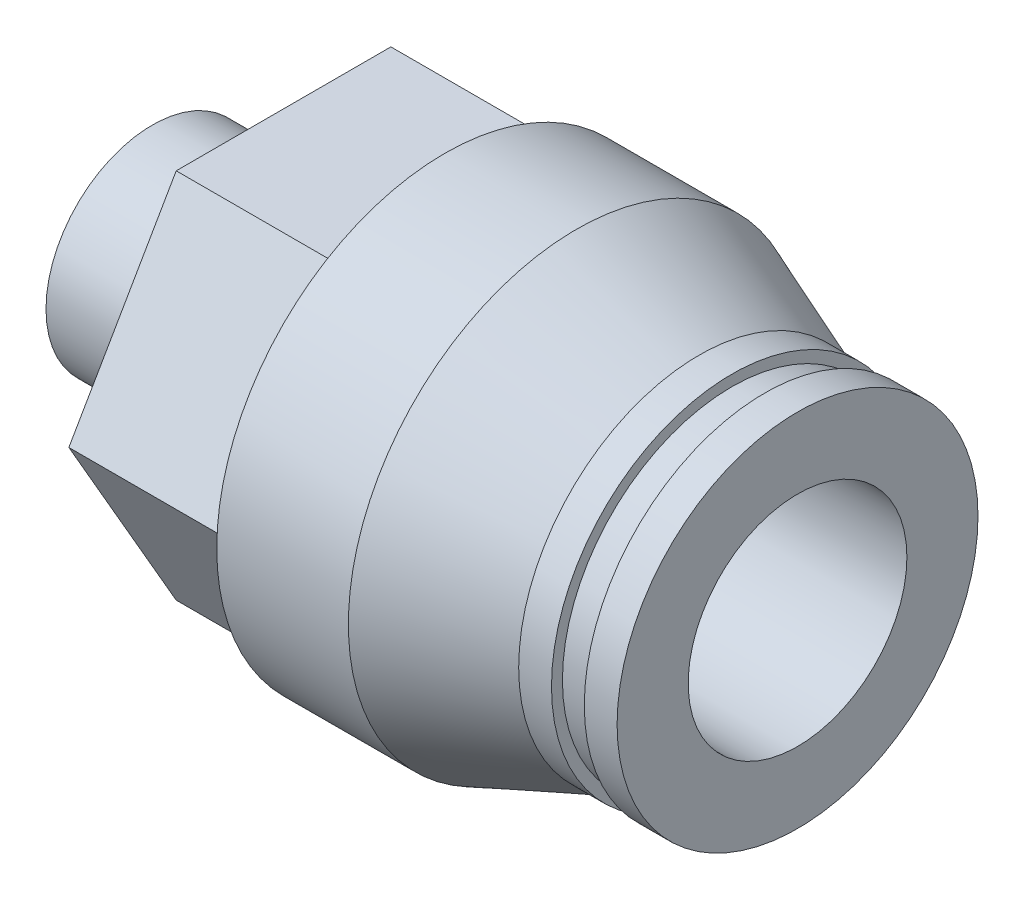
ISO-10303-21;
HEADER;
FILE_DESCRIPTION(('STEP AP214'),'2;1');
FILE_NAME('part.step','',(''),(''),'','','');
FILE_SCHEMA(('AUTOMOTIVE_DESIGN { 1 0 10303 214 1 1 1 1 }'));
ENDSEC;
DATA;
#1=APPLICATION_CONTEXT('core data for automotive mechanical design processes');
#2=APPLICATION_PROTOCOL_DEFINITION('international standard','automotive_design',2000,#1);
#3=PRODUCT_CONTEXT('',#1,'mechanical');
#4=PRODUCT('Part','Part','',(#3));
#5=PRODUCT_RELATED_PRODUCT_CATEGORY('part','',(#4));
#6=PRODUCT_DEFINITION_FORMATION('','',#4);
#7=PRODUCT_DEFINITION_CONTEXT('part definition',#1,'design');
#8=PRODUCT_DEFINITION('design','',#6,#7);
#9=PRODUCT_DEFINITION_SHAPE('','',#8);
#10=(LENGTH_UNIT() NAMED_UNIT(*) SI_UNIT(.MILLI.,.METRE.));
#11=(NAMED_UNIT(*) PLANE_ANGLE_UNIT() SI_UNIT($,.RADIAN.));
#12=(NAMED_UNIT(*) SI_UNIT($,.STERADIAN.) SOLID_ANGLE_UNIT());
#13=UNCERTAINTY_MEASURE_WITH_UNIT(LENGTH_MEASURE(1.E-05),#10,'distance_accuracy_value','');
#14=(GEOMETRIC_REPRESENTATION_CONTEXT(3) GLOBAL_UNCERTAINTY_ASSIGNED_CONTEXT((#13)) GLOBAL_UNIT_ASSIGNED_CONTEXT((#10,
#11,#12)) REPRESENTATION_CONTEXT('',''));
#15=CARTESIAN_POINT('',(0.,0.,0.));
#16=DIRECTION('',(0.,0.,1.));
#17=DIRECTION('',(1.,0.,0.));
#18=AXIS2_PLACEMENT_3D('',#15,#16,#17);
#19=CARTESIAN_POINT('',(6.,4.86,0.));
#20=DIRECTION('',(-1.,0.,0.));
#21=DIRECTION('',(0.,0.,1.));
#22=AXIS2_PLACEMENT_3D('',#19,#20,#21);
#23=PLANE('',#22);
#24=CARTESIAN_POINT('',(6.,0.,0.));
#25=DIRECTION('',(1.,0.,0.));
#26=DIRECTION('',(0.,0.,-1.));
#27=AXIS2_PLACEMENT_3D('',#24,#25,#26);
#28=CIRCLE('',#27,4.86);
#29=CARTESIAN_POINT('',(6.,0.,-4.86));
#30=VERTEX_POINT('',#29);
#31=EDGE_CURVE('E219',#30,#30,#28,.T.);
#32=ORIENTED_EDGE('',*,*,#31,.T.);
#33=EDGE_LOOP('',(#32));
#34=FACE_BOUND('',#33,.T.);
#35=DIRECTION('',(0.,-0.866025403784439,0.5));
#36=VECTOR('',#35,1.);
#37=CARTESIAN_POINT('',(6.,0.,-9.81495457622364));
#38=LINE('',#37,#36);
#39=CARTESIAN_POINT('',(6.,0.,-9.81495457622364));
#40=VERTEX_POINT('',#39);
#41=CARTESIAN_POINT('',(6.,-8.5,-4.90747728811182));
#42=VERTEX_POINT('',#41);
#43=EDGE_CURVE('E128',#40,#42,#38,.T.);
#44=ORIENTED_EDGE('',*,*,#43,.T.);
#45=DIRECTION('',(0.,0.,1.));
#46=VECTOR('',#45,1.);
#47=CARTESIAN_POINT('',(6.,-8.5,-4.90747728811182));
#48=LINE('',#47,#46);
#49=CARTESIAN_POINT('',(6.,-8.5,4.90747728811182));
#50=VERTEX_POINT('',#49);
#51=EDGE_CURVE('E111',#42,#50,#48,.T.);
#52=ORIENTED_EDGE('',*,*,#51,.T.);
#53=DIRECTION('',(0.,0.866025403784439,0.5));
#54=VECTOR('',#53,1.);
#55=CARTESIAN_POINT('',(6.,-8.5,4.90747728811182));
#56=LINE('',#55,#54);
#57=CARTESIAN_POINT('',(6.,0.,9.81495457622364));
#58=VERTEX_POINT('',#57);
#59=EDGE_CURVE('E122',#50,#58,#56,.T.);
#60=ORIENTED_EDGE('',*,*,#59,.T.);
#61=DIRECTION('',(0.,0.866025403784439,-0.5));
#62=VECTOR('',#61,1.);
#63=CARTESIAN_POINT('',(6.,0.,9.81495457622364));
#64=LINE('',#63,#62);
#65=CARTESIAN_POINT('',(6.,8.5,4.90747728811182));
#66=VERTEX_POINT('',#65);
#67=EDGE_CURVE('E31',#58,#66,#64,.T.);
#68=ORIENTED_EDGE('',*,*,#67,.T.);
#69=DIRECTION('',(0.,0.,-1.));
#70=VECTOR('',#69,1.);
#71=CARTESIAN_POINT('',(6.,8.5,4.90747728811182));
#72=LINE('',#71,#70);
#73=CARTESIAN_POINT('',(6.,8.5,-4.90747728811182));
#74=VERTEX_POINT('',#73);
#75=EDGE_CURVE('E132',#66,#74,#72,.T.);
#76=ORIENTED_EDGE('',*,*,#75,.T.);
#77=DIRECTION('',(0.,-0.866025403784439,-0.5));
#78=VECTOR('',#77,1.);
#79=CARTESIAN_POINT('',(6.,8.5,-4.90747728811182));
#80=LINE('',#79,#78);
#81=EDGE_CURVE('E135',#74,#40,#80,.T.);
#82=ORIENTED_EDGE('',*,*,#81,.T.);
#83=EDGE_LOOP('',(#44,#52,#60,#68,#76,#82));
#84=FACE_BOUND('',#83,.T.);
#85=ADVANCED_FACE('F16',(#34,#84),#23,.T.);
#86=CARTESIAN_POINT('',(0.,0.,0.));
#87=DIRECTION('',(-1.,0.,0.));
#88=DIRECTION('',(0.,0.,1.));
#89=AXIS2_PLACEMENT_3D('',#86,#87,#88);
#90=PLANE('',#89);
#91=CARTESIAN_POINT('',(0.,0.,0.));
#92=DIRECTION('',(1.,0.,0.));
#93=DIRECTION('',(0.,0.,-1.));
#94=AXIS2_PLACEMENT_3D('',#91,#92,#93);
#95=CIRCLE('',#94,4.86);
#96=CARTESIAN_POINT('',(0.,0.,-4.86));
#97=VERTEX_POINT('',#96);
#98=EDGE_CURVE('E222',#97,#97,#95,.T.);
#99=ORIENTED_EDGE('',*,*,#98,.F.);
#100=EDGE_LOOP('',(#99));
#101=FACE_BOUND('',#100,.T.);
#102=DIRECTION('',(0.,-0.866025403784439,-0.5));
#103=VECTOR('',#102,1.);
#104=CARTESIAN_POINT('',(0.,0.,2.88675134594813));
#105=LINE('',#104,#103);
#106=CARTESIAN_POINT('',(0.,0.,2.88675134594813));
#107=VERTEX_POINT('',#106);
#108=CARTESIAN_POINT('',(0.,-2.5,1.44337567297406));
#109=VERTEX_POINT('',#108);
#110=EDGE_CURVE('E177',#107,#109,#105,.T.);
#111=ORIENTED_EDGE('',*,*,#110,.T.);
#112=DIRECTION('',(0.,0.,-1.));
#113=VECTOR('',#112,1.);
#114=CARTESIAN_POINT('',(0.,-2.5,1.44337567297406));
#115=LINE('',#114,#113);
#116=CARTESIAN_POINT('',(0.,-2.5,-1.44337567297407));
#117=VERTEX_POINT('',#116);
#118=EDGE_CURVE('E39',#109,#117,#115,.T.);
#119=ORIENTED_EDGE('',*,*,#118,.T.);
#120=DIRECTION('',(0.,0.866025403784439,-0.5));
#121=VECTOR('',#120,1.);
#122=CARTESIAN_POINT('',(0.,-2.5,-1.44337567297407));
#123=LINE('',#122,#121);
#124=CARTESIAN_POINT('',(0.,0.,-2.88675134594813));
#125=VERTEX_POINT('',#124);
#126=EDGE_CURVE('E165',#117,#125,#123,.T.);
#127=ORIENTED_EDGE('',*,*,#126,.T.);
#128=DIRECTION('',(0.,0.866025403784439,0.5));
#129=VECTOR('',#128,1.);
#130=CARTESIAN_POINT('',(0.,0.,-2.88675134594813));
#131=LINE('',#130,#129);
#132=CARTESIAN_POINT('',(0.,2.5,-1.44337567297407));
#133=VERTEX_POINT('',#132);
#134=EDGE_CURVE('E168',#125,#133,#131,.T.);
#135=ORIENTED_EDGE('',*,*,#134,.T.);
#136=DIRECTION('',(0.,0.,1.));
#137=VECTOR('',#136,1.);
#138=CARTESIAN_POINT('',(0.,2.5,-1.44337567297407));
#139=LINE('',#138,#137);
#140=CARTESIAN_POINT('',(0.,2.5,1.44337567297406));
#141=VERTEX_POINT('',#140);
#142=EDGE_CURVE('E171',#133,#141,#139,.T.);
#143=ORIENTED_EDGE('',*,*,#142,.T.);
#144=DIRECTION('',(0.,-0.866025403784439,0.5));
#145=VECTOR('',#144,1.);
#146=CARTESIAN_POINT('',(0.,2.5,1.44337567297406));
#147=LINE('',#146,#145);
#148=EDGE_CURVE('E174',#141,#107,#147,.T.);
#149=ORIENTED_EDGE('',*,*,#148,.T.);
#150=EDGE_LOOP('',(#111,#119,#127,#135,#143,#149));
#151=FACE_BOUND('',#150,.T.);
#152=ADVANCED_FACE('F18',(#101,#151),#90,.T.);
#153=CARTESIAN_POINT('',(11.,5.,0.));
#154=DIRECTION('',(1.,0.,0.));
#155=DIRECTION('',(0.,0.,-1.));
#156=AXIS2_PLACEMENT_3D('',#153,#154,#155);
#157=PLANE('',#156);
#158=CARTESIAN_POINT('',(11.,0.,0.));
#159=DIRECTION('',(1.,0.,0.));
#160=DIRECTION('',(0.,0.,-1.));
#161=AXIS2_PLACEMENT_3D('',#158,#159,#160);
#162=CIRCLE('',#161,5.);
#163=CARTESIAN_POINT('',(11.,0.,-5.));
#164=VERTEX_POINT('',#163);
#165=EDGE_CURVE('E192',#164,#164,#162,.T.);
#166=ORIENTED_EDGE('',*,*,#165,.T.);
#167=EDGE_LOOP('',(#166));
#168=FACE_BOUND('',#167,.T.);
#169=DIRECTION('',(0.,-0.866025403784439,0.5));
#170=VECTOR('',#169,1.);
#171=CARTESIAN_POINT('',(11.,2.5,-4.3301270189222));
#172=LINE('',#171,#170);
#173=CARTESIAN_POINT('',(11.,0.,-2.88675134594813));
#174=VERTEX_POINT('',#173);
#175=CARTESIAN_POINT('',(11.,-2.5,-1.44337567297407));
#176=VERTEX_POINT('',#175);
#177=EDGE_CURVE('E24',#174,#176,#172,.T.);
#178=ORIENTED_EDGE('',*,*,#177,.T.);
#179=DIRECTION('',(0.,0.,1.));
#180=VECTOR('',#179,1.);
#181=CARTESIAN_POINT('',(11.,-2.5,0.));
#182=LINE('',#181,#180);
#183=CARTESIAN_POINT('',(11.,-2.5,1.44337567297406));
#184=VERTEX_POINT('',#183);
#185=EDGE_CURVE('E10',#176,#184,#182,.T.);
#186=ORIENTED_EDGE('',*,*,#185,.T.);
#187=DIRECTION('',(0.,0.866025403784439,0.5));
#188=VECTOR('',#187,1.);
#189=CARTESIAN_POINT('',(11.,2.5,4.33012701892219));
#190=LINE('',#189,#188);
#191=CARTESIAN_POINT('',(11.,0.,2.88675134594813));
#192=VERTEX_POINT('',#191);
#193=EDGE_CURVE('E225',#184,#192,#190,.T.);
#194=ORIENTED_EDGE('',*,*,#193,.T.);
#195=DIRECTION('',(0.,0.866025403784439,-0.5));
#196=VECTOR('',#195,1.);
#197=CARTESIAN_POINT('',(11.,5.,0.));
#198=LINE('',#197,#196);
#199=CARTESIAN_POINT('',(11.,2.5,1.44337567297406));
#200=VERTEX_POINT('',#199);
#201=EDGE_CURVE('E228',#192,#200,#198,.T.);
#202=ORIENTED_EDGE('',*,*,#201,.T.);
#203=DIRECTION('',(0.,0.,-1.));
#204=VECTOR('',#203,1.);
#205=CARTESIAN_POINT('',(11.,2.5,0.));
#206=LINE('',#205,#204);
#207=CARTESIAN_POINT('',(11.,2.5,-1.44337567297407));
#208=VERTEX_POINT('',#207);
#209=EDGE_CURVE('E231',#200,#208,#206,.T.);
#210=ORIENTED_EDGE('',*,*,#209,.T.);
#211=DIRECTION('',(0.,-0.866025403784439,-0.5));
#212=VECTOR('',#211,1.);
#213=CARTESIAN_POINT('',(11.,5.,0.));
#214=LINE('',#213,#212);
#215=EDGE_CURVE('E234',#208,#174,#214,.T.);
#216=ORIENTED_EDGE('',*,*,#215,.T.);
#217=EDGE_LOOP('',(#178,#186,#194,#202,#210,#216));
#218=FACE_BOUND('',#217,.T.);
#219=ADVANCED_FACE('F238',(#168,#218),#157,.T.);
#220=CARTESIAN_POINT('',(0.,0.,0.));
#221=DIRECTION('',(1.,0.,0.));
#222=DIRECTION('',(0.,0.,-1.));
#223=AXIS2_PLACEMENT_3D('',#220,#221,#222);
#224=CYLINDRICAL_SURFACE('',#223,4.86);
#225=ORIENTED_EDGE('',*,*,#98,.T.);
#226=EDGE_LOOP('',(#225));
#227=FACE_BOUND('',#226,.T.);
#228=ORIENTED_EDGE('',*,*,#31,.F.);
#229=EDGE_LOOP('',(#228));
#230=FACE_BOUND('',#229,.T.);
#231=ADVANCED_FACE('F279',(#227,#230),#224,.T.);
#232=CARTESIAN_POINT('',(0.,0.,0.));
#233=DIRECTION('',(1.,0.,0.));
#234=DIRECTION('',(0.,0.,-1.));
#235=AXIS2_PLACEMENT_3D('',#232,#233,#234);
#236=CYLINDRICAL_SURFACE('',#235,10.4285325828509);
#237=CARTESIAN_POINT('',(13.375,0.,0.));
#238=DIRECTION('',(-1.,0.,0.));
#239=DIRECTION('',(0.,0.,1.));
#240=AXIS2_PLACEMENT_3D('',#237,#238,#239);
#241=CIRCLE('',#240,10.4285325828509);
#242=CARTESIAN_POINT('',(13.375,0.,10.4285325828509));
#243=VERTEX_POINT('',#242);
#244=EDGE_CURVE('E154',#243,#243,#241,.F.);
#245=ORIENTED_EDGE('',*,*,#244,.T.);
#246=EDGE_LOOP('',(#245));
#247=FACE_BOUND('',#246,.T.);
#248=CARTESIAN_POINT('',(19.3916292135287,0.,0.));
#249=DIRECTION('',(1.,0.,0.));
#250=DIRECTION('',(0.,0.,-1.));
#251=AXIS2_PLACEMENT_3D('',#248,#249,#250);
#252=CIRCLE('',#251,10.4285325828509);
#253=CARTESIAN_POINT('',(19.3916292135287,0.,-10.4285325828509));
#254=VERTEX_POINT('',#253);
#255=EDGE_CURVE('E216',#254,#254,#252,.T.);
#256=ORIENTED_EDGE('',*,*,#255,.F.);
#257=EDGE_LOOP('',(#256));
#258=FACE_BOUND('',#257,.T.);
#259=ADVANCED_FACE('F277',(#247,#258),#236,.T.);
#260=CARTESIAN_POINT('',(25.,0.,0.));
#261=DIRECTION('',(-1.,0.,0.));
#262=DIRECTION('',(0.,0.,1.));
#263=AXIS2_PLACEMENT_3D('',#260,#261,#262);
#264=CONICAL_SURFACE('',#263,8.25,0.370503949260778);
#265=ORIENTED_EDGE('',*,*,#255,.T.);
#266=EDGE_LOOP('',(#265));
#267=FACE_BOUND('',#266,.T.);
#268=CARTESIAN_POINT('',(25.,0.,0.));
#269=DIRECTION('',(1.,0.,0.));
#270=DIRECTION('',(0.,0.,-1.));
#271=AXIS2_PLACEMENT_3D('',#268,#269,#270);
#272=CIRCLE('',#271,8.25);
#273=CARTESIAN_POINT('',(25.,0.,-8.25));
#274=VERTEX_POINT('',#273);
#275=EDGE_CURVE('E213',#274,#274,#272,.T.);
#276=ORIENTED_EDGE('',*,*,#275,.F.);
#277=EDGE_LOOP('',(#276));
#278=FACE_BOUND('',#277,.T.);
#279=ADVANCED_FACE('F286',(#267,#278),#264,.T.);
#280=CARTESIAN_POINT('',(0.,0.,0.));
#281=DIRECTION('',(1.,0.,0.));
#282=DIRECTION('',(0.,0.,-1.));
#283=AXIS2_PLACEMENT_3D('',#280,#281,#282);
#284=CYLINDRICAL_SURFACE('',#283,8.25);
#285=ORIENTED_EDGE('',*,*,#275,.T.);
#286=EDGE_LOOP('',(#285));
#287=FACE_BOUND('',#286,.T.);
#288=CARTESIAN_POINT('',(26.5,0.,0.));
#289=DIRECTION('',(1.,0.,0.));
#290=DIRECTION('',(0.,0.,-1.));
#291=AXIS2_PLACEMENT_3D('',#288,#289,#290);
#292=CIRCLE('',#291,8.25);
#293=CARTESIAN_POINT('',(26.5,0.,-8.25));
#294=VERTEX_POINT('',#293);
#295=EDGE_CURVE('E210',#294,#294,#292,.T.);
#296=ORIENTED_EDGE('',*,*,#295,.F.);
#297=EDGE_LOOP('',(#296));
#298=FACE_BOUND('',#297,.T.);
#299=ADVANCED_FACE('F313',(#287,#298),#284,.T.);
#300=CARTESIAN_POINT('',(26.5,8.25,0.));
#301=DIRECTION('',(1.,0.,0.));
#302=DIRECTION('',(0.,0.,-1.));
#303=AXIS2_PLACEMENT_3D('',#300,#301,#302);
#304=PLANE('',#303);
#305=ORIENTED_EDGE('',*,*,#295,.T.);
#306=EDGE_LOOP('',(#305));
#307=FACE_BOUND('',#306,.T.);
#308=CARTESIAN_POINT('',(26.5,0.,0.));
#309=DIRECTION('',(1.,0.,0.));
#310=DIRECTION('',(0.,0.,-1.));
#311=AXIS2_PLACEMENT_3D('',#308,#309,#310);
#312=CIRCLE('',#311,7.75);
#313=CARTESIAN_POINT('',(26.5,0.,-7.75));
#314=VERTEX_POINT('',#313);
#315=EDGE_CURVE('E207',#314,#314,#312,.T.);
#316=ORIENTED_EDGE('',*,*,#315,.F.);
#317=EDGE_LOOP('',(#316));
#318=FACE_BOUND('',#317,.T.);
#319=ADVANCED_FACE('F309',(#307,#318),#304,.T.);
#320=CARTESIAN_POINT('',(0.,0.,0.));
#321=DIRECTION('',(1.,0.,0.));
#322=DIRECTION('',(0.,0.,-1.));
#323=AXIS2_PLACEMENT_3D('',#320,#321,#322);
#324=CYLINDRICAL_SURFACE('',#323,7.75);
#325=ORIENTED_EDGE('',*,*,#315,.T.);
#326=EDGE_LOOP('',(#325));
#327=FACE_BOUND('',#326,.T.);
#328=CARTESIAN_POINT('',(28.,0.,0.));
#329=DIRECTION('',(1.,0.,0.));
#330=DIRECTION('',(0.,0.,-1.));
#331=AXIS2_PLACEMENT_3D('',#328,#329,#330);
#332=CIRCLE('',#331,7.75);
#333=CARTESIAN_POINT('',(28.,0.,-7.75));
#334=VERTEX_POINT('',#333);
#335=EDGE_CURVE('E204',#334,#334,#332,.T.);
#336=ORIENTED_EDGE('',*,*,#335,.F.);
#337=EDGE_LOOP('',(#336));
#338=FACE_BOUND('',#337,.T.);
#339=ADVANCED_FACE('F305',(#327,#338),#324,.T.);
#340=CARTESIAN_POINT('',(28.,7.75,0.));
#341=DIRECTION('',(-1.,0.,0.));
#342=DIRECTION('',(0.,0.,1.));
#343=AXIS2_PLACEMENT_3D('',#340,#341,#342);
#344=PLANE('',#343);
#345=ORIENTED_EDGE('',*,*,#335,.T.);
#346=EDGE_LOOP('',(#345));
#347=FACE_BOUND('',#346,.T.);
#348=CARTESIAN_POINT('',(28.,0.,0.));
#349=DIRECTION('',(1.,0.,0.));
#350=DIRECTION('',(0.,0.,-1.));
#351=AXIS2_PLACEMENT_3D('',#348,#349,#350);
#352=CIRCLE('',#351,8.25);
#353=CARTESIAN_POINT('',(28.,0.,-8.25));
#354=VERTEX_POINT('',#353);
#355=EDGE_CURVE('E201',#354,#354,#352,.T.);
#356=ORIENTED_EDGE('',*,*,#355,.F.);
#357=EDGE_LOOP('',(#356));
#358=FACE_BOUND('',#357,.T.);
#359=ADVANCED_FACE('F301',(#347,#358),#344,.T.);
#360=CARTESIAN_POINT('',(0.,0.,0.));
#361=DIRECTION('',(1.,0.,0.));
#362=DIRECTION('',(0.,0.,-1.));
#363=AXIS2_PLACEMENT_3D('',#360,#361,#362);
#364=CYLINDRICAL_SURFACE('',#363,8.25);
#365=ORIENTED_EDGE('',*,*,#355,.T.);
#366=EDGE_LOOP('',(#365));
#367=FACE_BOUND('',#366,.T.);
#368=CARTESIAN_POINT('',(29.5,0.,0.));
#369=DIRECTION('',(1.,0.,0.));
#370=DIRECTION('',(0.,0.,-1.));
#371=AXIS2_PLACEMENT_3D('',#368,#369,#370);
#372=CIRCLE('',#371,8.25);
#373=CARTESIAN_POINT('',(29.5,0.,-8.25));
#374=VERTEX_POINT('',#373);
#375=EDGE_CURVE('E198',#374,#374,#372,.T.);
#376=ORIENTED_EDGE('',*,*,#375,.F.);
#377=EDGE_LOOP('',(#376));
#378=FACE_BOUND('',#377,.T.);
#379=ADVANCED_FACE('F297',(#367,#378),#364,.T.);
#380=CARTESIAN_POINT('',(29.5,8.25,0.));
#381=DIRECTION('',(1.,0.,0.));
#382=DIRECTION('',(0.,0.,-1.));
#383=AXIS2_PLACEMENT_3D('',#380,#381,#382);
#384=PLANE('',#383);
#385=ORIENTED_EDGE('',*,*,#375,.T.);
#386=EDGE_LOOP('',(#385));
#387=FACE_BOUND('',#386,.T.);
#388=CARTESIAN_POINT('',(29.5,0.,0.));
#389=DIRECTION('',(1.,0.,0.));
#390=DIRECTION('',(0.,0.,-1.));
#391=AXIS2_PLACEMENT_3D('',#388,#389,#390);
#392=CIRCLE('',#391,5.);
#393=CARTESIAN_POINT('',(29.5,0.,-5.));
#394=VERTEX_POINT('',#393);
#395=EDGE_CURVE('E195',#394,#394,#392,.T.);
#396=ORIENTED_EDGE('',*,*,#395,.F.);
#397=EDGE_LOOP('',(#396));
#398=FACE_BOUND('',#397,.T.);
#399=ADVANCED_FACE('F265',(#387,#398),#384,.T.);
#400=CARTESIAN_POINT('',(0.,0.,0.));
#401=DIRECTION('',(1.,0.,0.));
#402=DIRECTION('',(0.,0.,-1.));
#403=AXIS2_PLACEMENT_3D('',#400,#401,#402);
#404=CYLINDRICAL_SURFACE('',#403,5.);
#405=ORIENTED_EDGE('',*,*,#395,.T.);
#406=EDGE_LOOP('',(#405));
#407=FACE_BOUND('',#406,.T.);
#408=ORIENTED_EDGE('',*,*,#165,.F.);
#409=EDGE_LOOP('',(#408));
#410=FACE_BOUND('',#409,.T.);
#411=ADVANCED_FACE('F257',(#407,#410),#404,.F.);
#412=CARTESIAN_POINT('',(29.5,-2.5,1.44337567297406));
#413=DIRECTION('',(0.,1.,0.));
#414=DIRECTION('',(0.,0.,1.));
#415=AXIS2_PLACEMENT_3D('',#412,#413,#414);
#416=PLANE('',#415);
#417=DIRECTION('',(-1.,0.,0.));
#418=VECTOR('',#417,1.);
#419=CARTESIAN_POINT('',(29.5,-2.5,-1.44337567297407));
#420=LINE('',#419,#418);
#421=EDGE_CURVE('E190',#176,#117,#420,.T.);
#422=ORIENTED_EDGE('',*,*,#421,.T.);
#423=ORIENTED_EDGE('',*,*,#118,.F.);
#424=DIRECTION('',(-1.,0.,0.));
#425=VECTOR('',#424,1.);
#426=CARTESIAN_POINT('',(29.5,-2.5,1.44337567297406));
#427=LINE('',#426,#425);
#428=EDGE_CURVE('E180',#184,#109,#427,.T.);
#429=ORIENTED_EDGE('',*,*,#428,.F.);
#430=ORIENTED_EDGE('',*,*,#185,.F.);
#431=EDGE_LOOP('',(#422,#423,#429,#430));
#432=FACE_BOUND('',#431,.T.);
#433=ADVANCED_FACE('F255',(#432),#416,.T.);
#434=CARTESIAN_POINT('',(29.5,-2.5,-1.44337567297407));
#435=DIRECTION('',(0.,0.5,0.866025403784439));
#436=DIRECTION('',(0.,-0.866025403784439,0.5));
#437=AXIS2_PLACEMENT_3D('',#434,#435,#436);
#438=PLANE('',#437);
#439=DIRECTION('',(-1.,0.,0.));
#440=VECTOR('',#439,1.);
#441=CARTESIAN_POINT('',(29.5,0.,-2.88675134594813));
#442=LINE('',#441,#440);
#443=EDGE_CURVE('E188',#174,#125,#442,.T.);
#444=ORIENTED_EDGE('',*,*,#443,.T.);
#445=ORIENTED_EDGE('',*,*,#126,.F.);
#446=ORIENTED_EDGE('',*,*,#421,.F.);
#447=ORIENTED_EDGE('',*,*,#177,.F.);
#448=EDGE_LOOP('',(#444,#445,#446,#447));
#449=FACE_BOUND('',#448,.T.);
#450=ADVANCED_FACE('F242',(#449),#438,.T.);
#451=CARTESIAN_POINT('',(29.5,0.,-2.88675134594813));
#452=DIRECTION('',(0.,-0.5,0.866025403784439));
#453=DIRECTION('',(0.,-0.866025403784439,-0.5));
#454=AXIS2_PLACEMENT_3D('',#451,#452,#453);
#455=PLANE('',#454);
#456=DIRECTION('',(-1.,0.,0.));
#457=VECTOR('',#456,1.);
#458=CARTESIAN_POINT('',(29.5,2.5,-1.44337567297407));
#459=LINE('',#458,#457);
#460=EDGE_CURVE('E186',#208,#133,#459,.T.);
#461=ORIENTED_EDGE('',*,*,#460,.T.);
#462=ORIENTED_EDGE('',*,*,#134,.F.);
#463=ORIENTED_EDGE('',*,*,#443,.F.);
#464=ORIENTED_EDGE('',*,*,#215,.F.);
#465=EDGE_LOOP('',(#461,#462,#463,#464));
#466=FACE_BOUND('',#465,.T.);
#467=ADVANCED_FACE('F246',(#466),#455,.T.);
#468=CARTESIAN_POINT('',(29.5,2.5,-1.44337567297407));
#469=DIRECTION('',(0.,-1.,0.));
#470=DIRECTION('',(0.,0.,-1.));
#471=AXIS2_PLACEMENT_3D('',#468,#469,#470);
#472=PLANE('',#471);
#473=DIRECTION('',(-1.,0.,0.));
#474=VECTOR('',#473,1.);
#475=CARTESIAN_POINT('',(29.5,2.5,1.44337567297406));
#476=LINE('',#475,#474);
#477=EDGE_CURVE('E184',#200,#141,#476,.T.);
#478=ORIENTED_EDGE('',*,*,#477,.T.);
#479=ORIENTED_EDGE('',*,*,#142,.F.);
#480=ORIENTED_EDGE('',*,*,#460,.F.);
#481=ORIENTED_EDGE('',*,*,#209,.F.);
#482=EDGE_LOOP('',(#478,#479,#480,#481));
#483=FACE_BOUND('',#482,.T.);
#484=ADVANCED_FACE('F406',(#483),#472,.T.);
#485=CARTESIAN_POINT('',(29.5,2.5,1.44337567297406));
#486=DIRECTION('',(0.,-0.5,-0.866025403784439));
#487=DIRECTION('',(0.,0.866025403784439,-0.5));
#488=AXIS2_PLACEMENT_3D('',#485,#486,#487);
#489=PLANE('',#488);
#490=DIRECTION('',(-1.,0.,0.));
#491=VECTOR('',#490,1.);
#492=CARTESIAN_POINT('',(29.5,0.,2.88675134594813));
#493=LINE('',#492,#491);
#494=EDGE_CURVE('E182',#192,#107,#493,.T.);
#495=ORIENTED_EDGE('',*,*,#494,.T.);
#496=ORIENTED_EDGE('',*,*,#148,.F.);
#497=ORIENTED_EDGE('',*,*,#477,.F.);
#498=ORIENTED_EDGE('',*,*,#201,.F.);
#499=EDGE_LOOP('',(#495,#496,#497,#498));
#500=FACE_BOUND('',#499,.T.);
#501=ADVANCED_FACE('F415',(#500),#489,.T.);
#502=CARTESIAN_POINT('',(29.5,0.,2.88675134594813));
#503=DIRECTION('',(0.,0.5,-0.866025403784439));
#504=DIRECTION('',(0.,0.866025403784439,0.5));
#505=AXIS2_PLACEMENT_3D('',#502,#503,#504);
#506=PLANE('',#505);
#507=ORIENTED_EDGE('',*,*,#428,.T.);
#508=ORIENTED_EDGE('',*,*,#110,.F.);
#509=ORIENTED_EDGE('',*,*,#494,.F.);
#510=ORIENTED_EDGE('',*,*,#193,.F.);
#511=EDGE_LOOP('',(#507,#508,#509,#510));
#512=FACE_BOUND('',#511,.T.);
#513=ADVANCED_FACE('F253',(#512),#506,.T.);
#514=CARTESIAN_POINT('',(13.375,0.,0.));
#515=DIRECTION('',(-1.,0.,0.));
#516=DIRECTION('',(0.,0.,1.));
#517=AXIS2_PLACEMENT_3D('',#514,#515,#516);
#518=PLANE('',#517);
#519=ORIENTED_EDGE('',*,*,#244,.F.);
#520=EDGE_LOOP('',(#519));
#521=FACE_BOUND('',#520,.T.);
#522=DIRECTION('',(0.,-0.866025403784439,0.5));
#523=VECTOR('',#522,1.);
#524=CARTESIAN_POINT('',(13.375,0.,-9.81495457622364));
#525=LINE('',#524,#523);
#526=CARTESIAN_POINT('',(13.375,0.,-9.81495457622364));
#527=VERTEX_POINT('',#526);
#528=CARTESIAN_POINT('',(13.375,-8.5,-4.90747728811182));
#529=VERTEX_POINT('',#528);
#530=EDGE_CURVE('E119',#527,#529,#525,.T.);
#531=ORIENTED_EDGE('',*,*,#530,.F.);
#532=DIRECTION('',(0.,-0.866025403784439,-0.5));
#533=VECTOR('',#532,1.);
#534=CARTESIAN_POINT('',(13.375,8.5,-4.90747728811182));
#535=LINE('',#534,#533);
#536=CARTESIAN_POINT('',(13.375,8.5,-4.90747728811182));
#537=VERTEX_POINT('',#536);
#538=EDGE_CURVE('E147',#537,#527,#535,.T.);
#539=ORIENTED_EDGE('',*,*,#538,.F.);
#540=DIRECTION('',(0.,0.,-1.));
#541=VECTOR('',#540,1.);
#542=CARTESIAN_POINT('',(13.375,8.5,4.90747728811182));
#543=LINE('',#542,#541);
#544=CARTESIAN_POINT('',(13.375,8.5,4.90747728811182));
#545=VERTEX_POINT('',#544);
#546=EDGE_CURVE('E144',#545,#537,#543,.T.);
#547=ORIENTED_EDGE('',*,*,#546,.F.);
#548=DIRECTION('',(0.,0.866025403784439,-0.5));
#549=VECTOR('',#548,1.);
#550=CARTESIAN_POINT('',(13.375,0.,9.81495457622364));
#551=LINE('',#550,#549);
#552=CARTESIAN_POINT('',(13.375,0.,9.81495457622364));
#553=VERTEX_POINT('',#552);
#554=EDGE_CURVE('E141',#553,#545,#551,.T.);
#555=ORIENTED_EDGE('',*,*,#554,.F.);
#556=DIRECTION('',(0.,0.866025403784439,0.5));
#557=VECTOR('',#556,1.);
#558=CARTESIAN_POINT('',(13.375,-8.5,4.90747728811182));
#559=LINE('',#558,#557);
#560=CARTESIAN_POINT('',(13.375,-8.5,4.90747728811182));
#561=VERTEX_POINT('',#560);
#562=EDGE_CURVE('E139',#561,#553,#559,.T.);
#563=ORIENTED_EDGE('',*,*,#562,.F.);
#564=DIRECTION('',(0.,0.,1.));
#565=VECTOR('',#564,1.);
#566=CARTESIAN_POINT('',(13.375,-8.5,-4.90747728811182));
#567=LINE('',#566,#565);
#568=EDGE_CURVE('E114',#529,#561,#567,.T.);
#569=ORIENTED_EDGE('',*,*,#568,.F.);
#570=EDGE_LOOP('',(#531,#539,#547,#555,#563,#569));
#571=FACE_BOUND('',#570,.T.);
#572=ADVANCED_FACE('F434',(#521,#571),#518,.T.);
#573=CARTESIAN_POINT('',(13.375,-8.5,-4.90747728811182));
#574=DIRECTION('',(0.,-1.,0.));
#575=DIRECTION('',(0.,0.,-1.));
#576=AXIS2_PLACEMENT_3D('',#573,#574,#575);
#577=PLANE('',#576);
#578=DIRECTION('',(-1.,0.,0.));
#579=VECTOR('',#578,1.);
#580=CARTESIAN_POINT('',(13.375,-8.5,-4.90747728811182));
#581=LINE('',#580,#579);
#582=EDGE_CURVE('E152',#529,#42,#581,.T.);
#583=ORIENTED_EDGE('',*,*,#582,.F.);
#584=ORIENTED_EDGE('',*,*,#568,.T.);
#585=DIRECTION('',(-1.,0.,0.));
#586=VECTOR('',#585,1.);
#587=CARTESIAN_POINT('',(13.375,-8.5,4.90747728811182));
#588=LINE('',#587,#586);
#589=EDGE_CURVE('E107',#561,#50,#588,.T.);
#590=ORIENTED_EDGE('',*,*,#589,.T.);
#591=ORIENTED_EDGE('',*,*,#51,.F.);
#592=EDGE_LOOP('',(#583,#584,#590,#591));
#593=FACE_BOUND('',#592,.T.);
#594=ADVANCED_FACE('F109',(#593),#577,.T.);
#595=CARTESIAN_POINT('',(13.375,0.,-9.81495457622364));
#596=DIRECTION('',(0.,-0.5,-0.866025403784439));
#597=DIRECTION('',(0.,0.866025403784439,-0.5));
#598=AXIS2_PLACEMENT_3D('',#595,#596,#597);
#599=PLANE('',#598);
#600=DIRECTION('',(-1.,0.,0.));
#601=VECTOR('',#600,1.);
#602=CARTESIAN_POINT('',(13.375,0.,-9.81495457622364));
#603=LINE('',#602,#601);
#604=EDGE_CURVE('E155',#527,#40,#603,.T.);
#605=ORIENTED_EDGE('',*,*,#604,.F.);
#606=ORIENTED_EDGE('',*,*,#530,.T.);
#607=ORIENTED_EDGE('',*,*,#582,.T.);
#608=ORIENTED_EDGE('',*,*,#43,.F.);
#609=EDGE_LOOP('',(#605,#606,#607,#608));
#610=FACE_BOUND('',#609,.T.);
#611=ADVANCED_FACE('F452',(#610),#599,.T.);
#612=CARTESIAN_POINT('',(13.375,8.5,-4.90747728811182));
#613=DIRECTION('',(0.,0.5,-0.866025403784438));
#614=DIRECTION('',(0.,0.866025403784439,0.5));
#615=AXIS2_PLACEMENT_3D('',#612,#613,#614);
#616=PLANE('',#615);
#617=DIRECTION('',(-1.,0.,0.));
#618=VECTOR('',#617,1.);
#619=CARTESIAN_POINT('',(13.375,8.5,-4.90747728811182));
#620=LINE('',#619,#618);
#621=EDGE_CURVE('E157',#537,#74,#620,.T.);
#622=ORIENTED_EDGE('',*,*,#621,.F.);
#623=ORIENTED_EDGE('',*,*,#538,.T.);
#624=ORIENTED_EDGE('',*,*,#604,.T.);
#625=ORIENTED_EDGE('',*,*,#81,.F.);
#626=EDGE_LOOP('',(#622,#623,#624,#625));
#627=FACE_BOUND('',#626,.T.);
#628=ADVANCED_FACE('F461',(#627),#616,.T.);
#629=CARTESIAN_POINT('',(13.375,8.5,4.90747728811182));
#630=DIRECTION('',(0.,1.,0.));
#631=DIRECTION('',(0.,0.,1.));
#632=AXIS2_PLACEMENT_3D('',#629,#630,#631);
#633=PLANE('',#632);
#634=DIRECTION('',(-1.,0.,0.));
#635=VECTOR('',#634,1.);
#636=CARTESIAN_POINT('',(13.375,8.5,4.90747728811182));
#637=LINE('',#636,#635);
#638=EDGE_CURVE('E159',#545,#66,#637,.T.);
#639=ORIENTED_EDGE('',*,*,#638,.F.);
#640=ORIENTED_EDGE('',*,*,#546,.T.);
#641=ORIENTED_EDGE('',*,*,#621,.T.);
#642=ORIENTED_EDGE('',*,*,#75,.F.);
#643=EDGE_LOOP('',(#639,#640,#641,#642));
#644=FACE_BOUND('',#643,.T.);
#645=ADVANCED_FACE('F471',(#644),#633,.T.);
#646=CARTESIAN_POINT('',(13.375,0.,9.81495457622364));
#647=DIRECTION('',(0.,0.5,0.866025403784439));
#648=DIRECTION('',(0.,-0.866025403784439,0.5));
#649=AXIS2_PLACEMENT_3D('',#646,#647,#648);
#650=PLANE('',#649);
#651=DIRECTION('',(-1.,0.,0.));
#652=VECTOR('',#651,1.);
#653=CARTESIAN_POINT('',(13.375,0.,9.81495457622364));
#654=LINE('',#653,#652);
#655=EDGE_CURVE('E118',#553,#58,#654,.T.);
#656=ORIENTED_EDGE('',*,*,#655,.F.);
#657=ORIENTED_EDGE('',*,*,#554,.T.);
#658=ORIENTED_EDGE('',*,*,#638,.T.);
#659=ORIENTED_EDGE('',*,*,#67,.F.);
#660=EDGE_LOOP('',(#656,#657,#658,#659));
#661=FACE_BOUND('',#660,.T.);
#662=ADVANCED_FACE('F481',(#661),#650,.T.);
#663=CARTESIAN_POINT('',(13.375,-8.5,4.90747728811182));
#664=DIRECTION('',(0.,-0.5,0.866025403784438));
#665=DIRECTION('',(0.,-0.866025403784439,-0.5));
#666=AXIS2_PLACEMENT_3D('',#663,#664,#665);
#667=PLANE('',#666);
#668=ORIENTED_EDGE('',*,*,#589,.F.);
#669=ORIENTED_EDGE('',*,*,#562,.T.);
#670=ORIENTED_EDGE('',*,*,#655,.T.);
#671=ORIENTED_EDGE('',*,*,#59,.F.);
#672=EDGE_LOOP('',(#668,#669,#670,#671));
#673=FACE_BOUND('',#672,.T.);
#674=ADVANCED_FACE('F123',(#673),#667,.T.);
#675=CLOSED_SHELL('',(#85,#152,#219,#231,#259,#279,#299,#319,#339,#359,#379,#399,#411,#433,#450,
#467,#484,#501,#513,#572,#594,#611,#628,#645,#662,#674));
#676=MANIFOLD_SOLID_BREP('B1',#675);
#677=ADVANCED_BREP_SHAPE_REPRESENTATION('',(#18,#676),#14);
#678=SHAPE_DEFINITION_REPRESENTATION(#9,#677);
ENDSEC;
END-ISO-10303-21;
